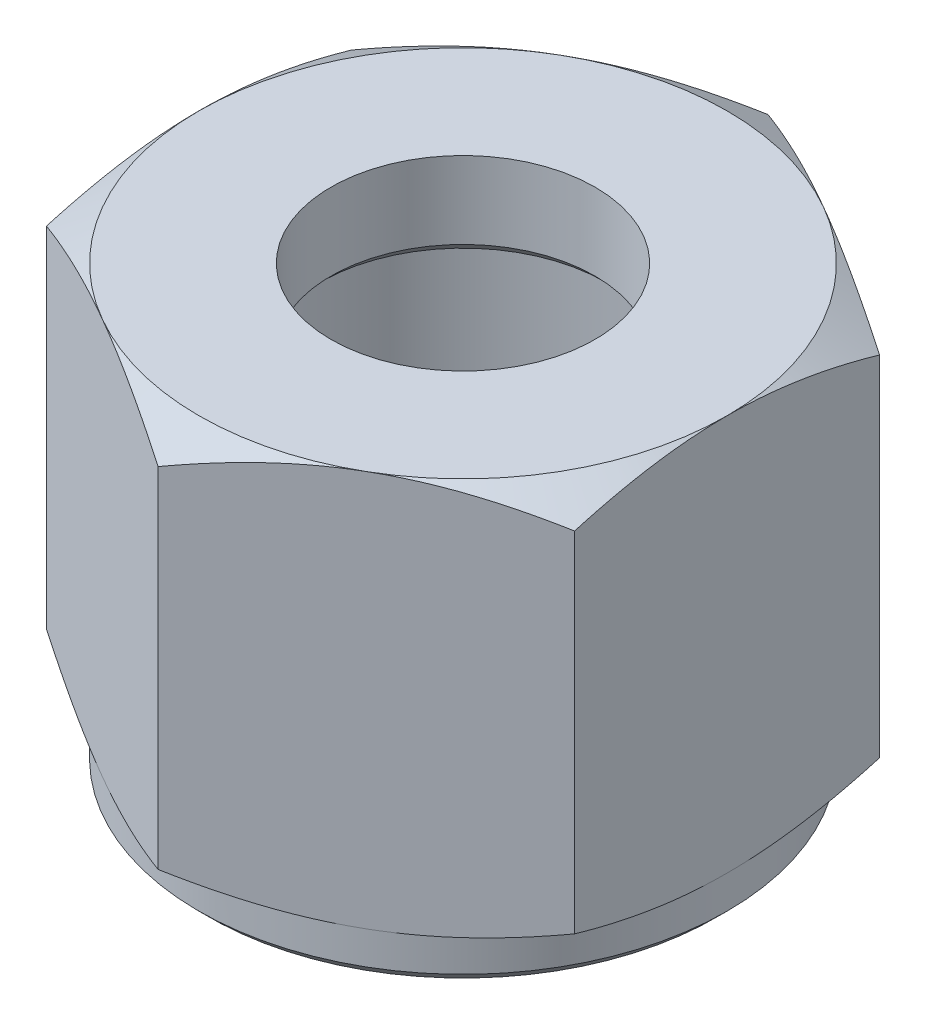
from build123d import *

# Parameters (mm, degrees)
P_IDAT_VYSUNUT_M1_DEPTH  = 18
SKICA2_OUTSIDE_W         = 96.522
SKICA2_OUTSIDE_H         = 100.234
SKICA2_OUTSIDE_R         = 12
ODEBRAT_VYSUNUT_M1_DEPTH = 18
ODEBRAT_VYSUNUT_M1_DRAFT = -60
SKICA3_OUTSIDE_W         = 96.522
SKICA3_OUTSIDE_H         = 100.234
SKICA3_OUTSIDE_R         = 12
ODEBRAT_VYSUNUT_M2_DEPTH = 18
ODEBRAT_VYSUNUT_M2_DRAFT = -60
SKICA4_R                 = 12
P_IDAT_VYSUNUT_M2_DEPTH  = 2
ZKOSEN_1_SIZE            = 0.5
SKICA5_R                 = 9
ODEBRAT_VYSUNUT_M3_DEPTH = 16
ZKOSEN_2_SIZE            = 0.35
SKICA6_R                 = 6
ODEBRAT_VYSUNUT_M4_DEPTH = 4
ZKOSEN_3_SIZE            = 0.5


with BuildPart() as part:
    # Skica1 → P_idat vysunut_m1 (new body)
    with BuildSketch(Plane(origin=(0, 0, 0), x_dir=(1, 0, 0), z_dir=(0, 1, 0))):
        Polygon((0, 13.856406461), (-12, 6.92820323), (-12, -6.92820323), (0, -13.856406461), (12, -6.92820323), (12, 6.92820323), align=None)
    extrude(amount=P_IDAT_VYSUNUT_M1_DEPTH)


with BuildPart() as odebrat_vysunut_m1_tool:
    # Skica2 outside → Odebrat vysunut_m1 (with draft: the straight prism first)
    with BuildSketch(Plane(origin=(0, 18, 0), x_dir=(-1, 0, 0), z_dir=(0, 1, 0))):
        Rectangle(SKICA2_OUTSIDE_W, SKICA2_OUTSIDE_H)
        Circle(SKICA2_OUTSIDE_R, mode=Mode.SUBTRACT)
    extrude(amount=-ODEBRAT_VYSUNUT_M1_DEPTH)
    # Odebrat vysunut_m1: the draft: its side faces are tilted about the plane it starts from
    odebrat_vysunut_m1_sides = [odebrat_vysunut_m1_tool.faces().sort_by_distance(p)[0] for p in [
        (0, 9, -50.117),
        (-48.261, 9, 0),
        (0, 9, 50.117),
        (48.261, 9, 0),
        (12, 9, 0),
    ]]
    draft(odebrat_vysunut_m1_sides, Plane(origin=(0, 18, 0), x_dir=(-1, 0, 0), z_dir=(0, 1, 0)), ODEBRAT_VYSUNUT_M1_DRAFT)


with BuildPart() as part_1:
    add(part.part)

    # Odebrat vysunut_m1: cut by odebrat_vysunut_m1_tool
    add(odebrat_vysunut_m1_tool.part, mode=Mode.SUBTRACT)


with BuildPart() as odebrat_vysunut_m2_tool:
    # Skica3 outside → Odebrat vysunut_m2 (with draft: the straight prism first)
    with BuildSketch(Plane.XZ):
        Rectangle(SKICA3_OUTSIDE_W, SKICA3_OUTSIDE_H)
        Circle(SKICA3_OUTSIDE_R, mode=Mode.SUBTRACT)
    extrude(amount=-ODEBRAT_VYSUNUT_M2_DEPTH)
    # Odebrat vysunut_m2: the draft: its side faces are tilted about the plane it starts from
    odebrat_vysunut_m2_sides = [odebrat_vysunut_m2_tool.faces().sort_by_distance(p)[0] for p in [
        (0, 9, -50.117),
        (48.261, 9, 0),
        (0, 9, 50.117),
        (-48.261, 9, 0),
        (-12, 9, 0),
    ]]
    draft(odebrat_vysunut_m2_sides, Plane.XZ, ODEBRAT_VYSUNUT_M2_DRAFT)


with BuildPart() as part_2:
    add(part_1.part)

    # Odebrat vysunut_m2: cut by odebrat_vysunut_m2_tool
    add(odebrat_vysunut_m2_tool.part, mode=Mode.SUBTRACT)

    # Skica4 → P_idat vysunut_m2 (add)
    with BuildSketch(Plane.XZ):
        with Locations(Location((0, 0, 0), (0, 0, 60))):
            Circle(SKICA4_R)
    extrude(amount=P_IDAT_VYSUNUT_M2_DEPTH)

    # Zkosen_1
    zkosen_1_edges = [part_2.edges().sort_by_distance(p)[0] for p in [
        (-6, -2, -10.392304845),
    ]]
    chamfer(zkosen_1_edges, length=ZKOSEN_1_SIZE)

    # Skica5 → Odebrat vysunut_m3 (cut)
    with BuildSketch(Plane.XZ.offset(2)):
        with Locations(Location((0, 0, 0), (0, 0, 270))):
            Circle(SKICA5_R)
    extrude(amount=-ODEBRAT_VYSUNUT_M3_DEPTH, mode=Mode.SUBTRACT)

    # Zkosen_2
    zkosen_2_edges = [part_2.edges().sort_by_distance(p)[0] for p in [
        (0, -2, 9),
    ]]
    chamfer(zkosen_2_edges, length=ZKOSEN_2_SIZE)

    # Skica6 → Odebrat vysunut_m4 (cut)
    with BuildSketch(Plane(origin=(0, 18, 0), x_dir=(1, 0, 0), z_dir=(0, 1, 0))):
        with Locations(Location((0, 0, 0), (0, 0, 270))):
            Circle(SKICA6_R)
    extrude(amount=-ODEBRAT_VYSUNUT_M4_DEPTH, mode=Mode.SUBTRACT)

    # Zkosen_3
    zkosen_3_edges = [part_2.edges().sort_by_distance(p)[0] for p in [
        (0, 14, -6),
    ]]
    chamfer(zkosen_3_edges, length=ZKOSEN_3_SIZE)


solid = part_2.part
